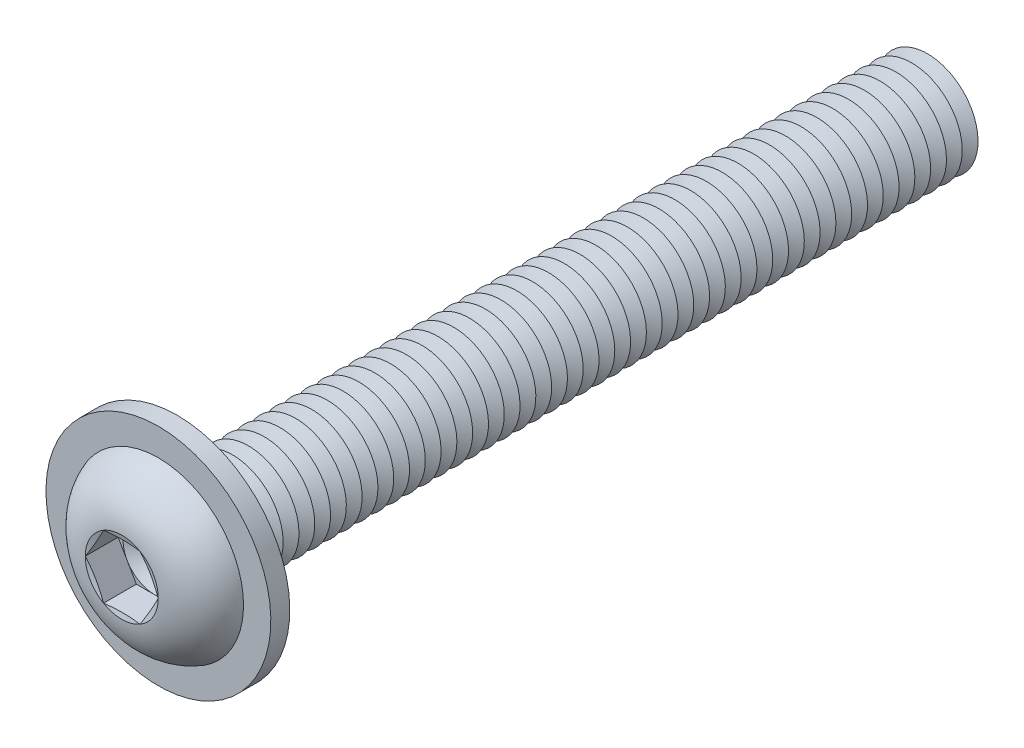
from build123d import *

# Parameters (mm, degrees)
FILLET1_R           = 0.625
LPATTERN1_COUNT     = 48
LPATTERN1_PITCH     = 1.25
CUT_EXTRUDE1_DEPTH  = 2.6
SKETCH5_R           = 8.9
SKETCH5_R_2         = 4.625
BOSS_EXTRUDE1_DEPTH = 1.5


with BuildPart() as part:
    # Sketch1 → Revolve1 (revolve)
    with BuildSketch(Plane(origin=(0, 0, 0), x_dir=(0, 0, -1), z_dir=(1, 0, 0))):
        with BuildLine():
            Line((0, 4), (0, 7))
            ThreePointArc((0, 7), (-3.011595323, 5.81154966), (-4.4, 2.88675))
            Line((-4.4, 2.88675), (-4.013248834, 1.443375))
            Line((-4.013248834, 1.443375), (-4.4, 1.443375))
            Line((-4.4, 1.443375), (-4.4, 0))
            Line((-4.4, 0), (60, 0))
            Line((60, 0), (60, 4))
            Line((60, 4), (0, 4))
        make_face()
    revolve(axis=Axis((0, 0, -60), (0, 0, 1)))

    # Fillet1
    fillet1_edges = [part.edges().sort_by_distance(p)[0] for p in [
        (0, -4, 0),
    ]]
    fillet(fillet1_edges, radius=FILLET1_R)

    # Sketch2 → Cut-Revolve1 (revolve, cut)
    with BuildSketch(Plane(origin=(0, 0, 0), x_dir=(0, 0, -1), z_dir=(1, 0, 0))):
        Polygon((59.375, 4), (60.625, 4), (60, 2.917468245), align=None)
    cut_revolve1 = revolve(axis=Axis((0, 0, -60), (0, 0, -1)), mode=Mode.SUBTRACT)

    # LPattern1: Cut-Revolve1 ×48
    with Locations(*[(0, 0, i * LPATTERN1_PITCH) for i in range(1, LPATTERN1_COUNT)]):
        add(cut_revolve1, mode=Mode.SUBTRACT)

    # Sketch3 → Cut-Extrude1 (cut)
    with BuildSketch(Plane.XY.offset(4.4)):
        Polygon((1.443375, 2.499998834), (-1.443375, 2.499998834), (-2.88675, 0), (-1.443375, -2.499998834), (1.443375, -2.499998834), (2.88675, 0), align=None)
    extrude(amount=-CUT_EXTRUDE1_DEPTH, mode=Mode.SUBTRACT)

    # Cut-Extrude2 cone 1 section (on through the dimple's axis) → Cut-Extrude2 (revolve, cut)
    with BuildSketch(Plane(origin=(0, 0, 1.8), x_dir=(0, -1, 0), z_dir=(1, 0, 0))):
        Polygon((0, 0), (2.499998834, 0), (0, 1.443375), align=None)
    revolve(axis=Axis((0, 0, 1.8), (0, 0, -1)), mode=Mode.SUBTRACT)

    # Sketch5 → Boss-Extrude1 (add)
    with BuildSketch(Plane(origin=(0, 0, 0), x_dir=(-1, 0, 0), z_dir=(0, 0, -1))):
        with Locations(Location((0, 0, 0), (0, 0, 90))):
            Circle(SKETCH5_R)
        Circle(SKETCH5_R_2, mode=Mode.SUBTRACT)
    extrude(amount=-BOSS_EXTRUDE1_DEPTH)


solid = part.part
